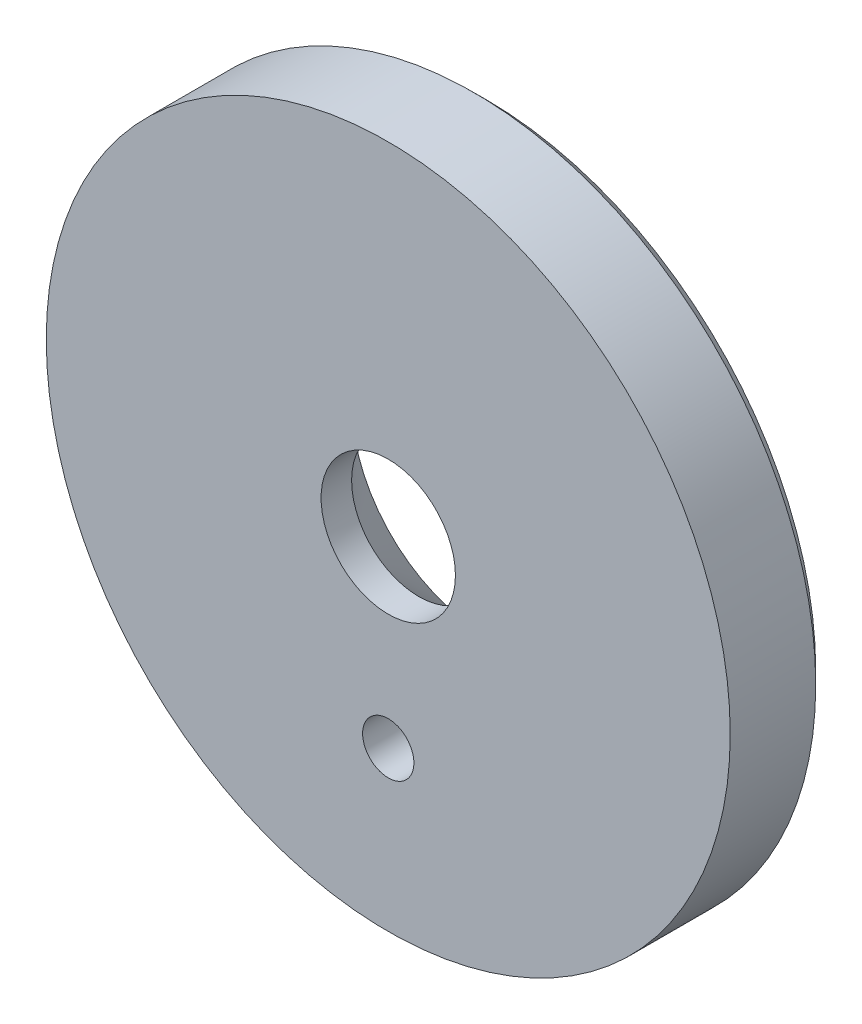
from build123d import *

# Parameters (mm, degrees)
SKETCH1_R          = 14
SKETCH1_R_2        = 2.75
BASE_EXTRUDE_DEPTH = 4
CHAMFER1_SIZE      = 0.5
SKETCH3_R          = 1.05
HOLE_EXSCIND_DEPTH = 37.301976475


with BuildPart() as part:
    # Sketch1 → Base-Extrude (new body)
    with BuildSketch(Plane.XY):
        Circle(SKETCH1_R)
        Circle(SKETCH1_R_2, mode=Mode.SUBTRACT)
    extrude(amount=-BASE_EXTRUDE_DEPTH)

    # Sketch2 → Cut-Revolve1 (revolve, cut)
    with BuildSketch(Plane(origin=(0, 0, 0), x_dir=(1, 0, 0), z_dir=(0, 1, 0)), mode=Mode.PRIVATE) as cut_revolve1_sk:
        Polygon((-5.5, 4), (-2.75, 4), (-2.75, 1.25), align=None)
    revolve(cut_revolve1_sk.sketch.rotate(Axis((0, 0, -8.465583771), (0, 0, 1)), 180), axis=Axis((0, 0, -8.465583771), (0, 0, 1)), mode=Mode.SUBTRACT)

    # Chamfer1
    chamfer1_edges = [part.edges().sort_by_distance(p)[0] for p in [
        (-14, 0, -4),
    ]]
    chamfer(chamfer1_edges, length=CHAMFER1_SIZE)

    # Sketch3 → Hole-Exscind (cut, through all)
    with BuildSketch(Plane(origin=(-5.32130403, -16.47163774, -4), x_dir=(-1, 0, 0), z_dir=(0, 0, -1))):
        with Locations((-5.32130403, 8.97163774)):
            Circle(SKETCH3_R)
    extrude(amount=-HOLE_EXSCIND_DEPTH, mode=Mode.SUBTRACT)


solid = part.part
